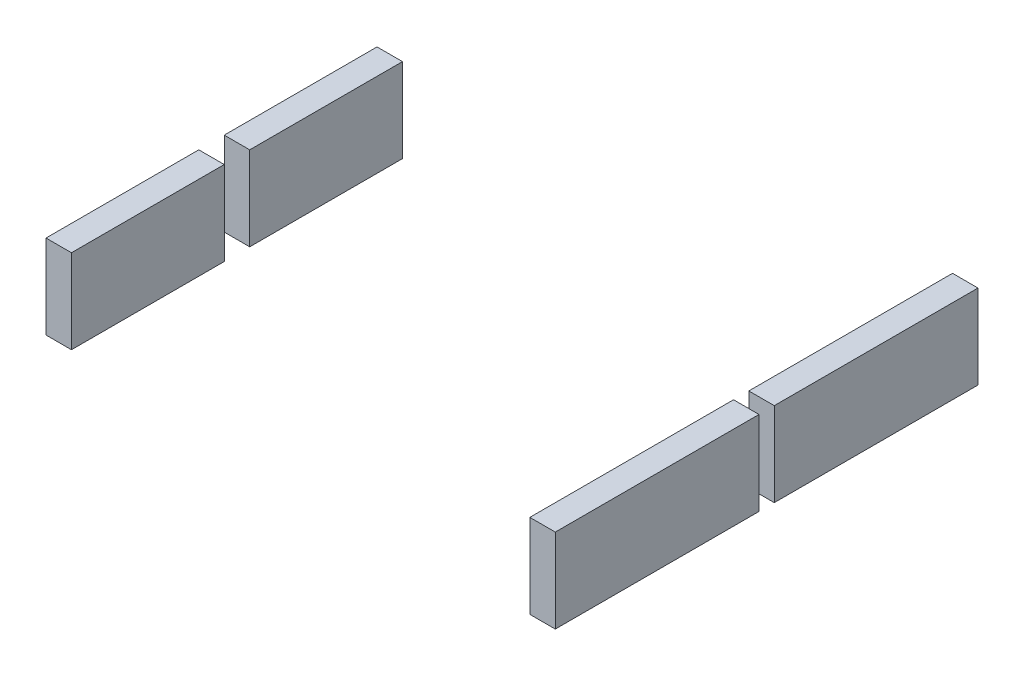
ISO-10303-21;
HEADER;
FILE_DESCRIPTION(('STEP AP214'),'2;1');
FILE_NAME('part.step','',(''),(''),'','','');
FILE_SCHEMA(('AUTOMOTIVE_DESIGN { 1 0 10303 214 1 1 1 1 }'));
ENDSEC;
DATA;
#1=APPLICATION_CONTEXT('core data for automotive mechanical design processes');
#2=APPLICATION_PROTOCOL_DEFINITION('international standard','automotive_design',2000,#1);
#3=PRODUCT_CONTEXT('',#1,'mechanical');
#4=PRODUCT('Part','Part','',(#3));
#5=PRODUCT_RELATED_PRODUCT_CATEGORY('part','',(#4));
#6=PRODUCT_DEFINITION_FORMATION('','',#4);
#7=PRODUCT_DEFINITION_CONTEXT('part definition',#1,'design');
#8=PRODUCT_DEFINITION('design','',#6,#7);
#9=PRODUCT_DEFINITION_SHAPE('','',#8);
#10=(LENGTH_UNIT() NAMED_UNIT(*) SI_UNIT(.MILLI.,.METRE.));
#11=(NAMED_UNIT(*) PLANE_ANGLE_UNIT() SI_UNIT($,.RADIAN.));
#12=(NAMED_UNIT(*) SI_UNIT($,.STERADIAN.) SOLID_ANGLE_UNIT());
#13=UNCERTAINTY_MEASURE_WITH_UNIT(LENGTH_MEASURE(1.E-05),#10,'distance_accuracy_value','');
#14=(GEOMETRIC_REPRESENTATION_CONTEXT(3) GLOBAL_UNCERTAINTY_ASSIGNED_CONTEXT((#13)) GLOBAL_UNIT_ASSIGNED_CONTEXT((#10,
#11,#12)) REPRESENTATION_CONTEXT('',''));
#15=CARTESIAN_POINT('',(0.,0.,0.));
#16=DIRECTION('',(0.,0.,1.));
#17=DIRECTION('',(1.,0.,0.));
#18=AXIS2_PLACEMENT_3D('',#15,#16,#17);
#19=CARTESIAN_POINT('',(-48.26,8.382,-17.78));
#20=DIRECTION('',(-1.,0.,0.));
#21=DIRECTION('',(0.,0.,1.));
#22=AXIS2_PLACEMENT_3D('',#19,#20,#21);
#23=PLANE('',#22);
#24=DIRECTION('',(0.,0.,-1.));
#25=VECTOR('',#24,1.);
#26=CARTESIAN_POINT('',(-48.26,0.,-17.78));
#27=LINE('',#26,#25);
#28=CARTESIAN_POINT('',(-48.26,0.,-17.78));
#29=VERTEX_POINT('',#28);
#30=CARTESIAN_POINT('',(-48.26,0.,-33.02));
#31=VERTEX_POINT('',#30);
#32=EDGE_CURVE('E104',#29,#31,#27,.T.);
#33=ORIENTED_EDGE('',*,*,#32,.T.);
#34=DIRECTION('',(0.,-1.,0.));
#35=VECTOR('',#34,1.);
#36=CARTESIAN_POINT('',(-48.26,8.382,-33.02));
#37=LINE('',#36,#35);
#38=CARTESIAN_POINT('',(-48.26,8.382,-33.02));
#39=VERTEX_POINT('',#38);
#40=EDGE_CURVE('E12',#39,#31,#37,.T.);
#41=ORIENTED_EDGE('',*,*,#40,.F.);
#42=DIRECTION('',(0.,0.,-1.));
#43=VECTOR('',#42,1.);
#44=CARTESIAN_POINT('',(-48.26,8.382,-17.78));
#45=LINE('',#44,#43);
#46=CARTESIAN_POINT('',(-48.26,8.382,-17.78));
#47=VERTEX_POINT('',#46);
#48=EDGE_CURVE('E92',#47,#39,#45,.T.);
#49=ORIENTED_EDGE('',*,*,#48,.F.);
#50=DIRECTION('',(0.,-1.,0.));
#51=VECTOR('',#50,1.);
#52=CARTESIAN_POINT('',(-48.26,8.382,-17.78));
#53=LINE('',#52,#51);
#54=EDGE_CURVE('E100',#47,#29,#53,.T.);
#55=ORIENTED_EDGE('',*,*,#54,.T.);
#56=EDGE_LOOP('',(#33,#41,#49,#55));
#57=FACE_BOUND('',#56,.T.);
#58=ADVANCED_FACE('F41',(#57),#23,.F.);
#59=CARTESIAN_POINT('',(-48.26,8.382,-33.02));
#60=DIRECTION('',(0.,0.,1.));
#61=DIRECTION('',(1.,0.,0.));
#62=AXIS2_PLACEMENT_3D('',#59,#60,#61);
#63=PLANE('',#62);
#64=DIRECTION('',(-1.,0.,0.));
#65=VECTOR('',#64,1.);
#66=CARTESIAN_POINT('',(-48.26,0.,-33.02));
#67=LINE('',#66,#65);
#68=CARTESIAN_POINT('',(-50.8,0.,-33.02));
#69=VERTEX_POINT('',#68);
#70=EDGE_CURVE('E96',#31,#69,#67,.T.);
#71=ORIENTED_EDGE('',*,*,#70,.T.);
#72=DIRECTION('',(0.,-1.,0.));
#73=VECTOR('',#72,1.);
#74=CARTESIAN_POINT('',(-50.8,8.382,-33.02));
#75=LINE('',#74,#73);
#76=CARTESIAN_POINT('',(-50.8,8.382,-33.02));
#77=VERTEX_POINT('',#76);
#78=EDGE_CURVE('E49',#77,#69,#75,.T.);
#79=ORIENTED_EDGE('',*,*,#78,.F.);
#80=DIRECTION('',(-1.,0.,0.));
#81=VECTOR('',#80,1.);
#82=CARTESIAN_POINT('',(-48.26,8.382,-33.02));
#83=LINE('',#82,#81);
#84=EDGE_CURVE('E87',#39,#77,#83,.T.);
#85=ORIENTED_EDGE('',*,*,#84,.F.);
#86=ORIENTED_EDGE('',*,*,#40,.T.);
#87=EDGE_LOOP('',(#71,#79,#85,#86));
#88=FACE_BOUND('',#87,.T.);
#89=ADVANCED_FACE('F95',(#88),#63,.F.);
#90=CARTESIAN_POINT('',(-50.8,8.382,-17.78));
#91=DIRECTION('',(1.,0.,0.));
#92=DIRECTION('',(0.,0.,-1.));
#93=AXIS2_PLACEMENT_3D('',#90,#91,#92);
#94=PLANE('',#93);
#95=DIRECTION('',(0.,0.,1.));
#96=VECTOR('',#95,1.);
#97=CARTESIAN_POINT('',(-50.8,0.,-17.78));
#98=LINE('',#97,#96);
#99=CARTESIAN_POINT('',(-50.8,0.,-17.78));
#100=VERTEX_POINT('',#99);
#101=EDGE_CURVE('E74',#69,#100,#98,.T.);
#102=ORIENTED_EDGE('',*,*,#101,.T.);
#103=DIRECTION('',(0.,-1.,0.));
#104=VECTOR('',#103,1.);
#105=CARTESIAN_POINT('',(-50.8,8.382,-17.78));
#106=LINE('',#105,#104);
#107=CARTESIAN_POINT('',(-50.8,8.382,-17.78));
#108=VERTEX_POINT('',#107);
#109=EDGE_CURVE('E97',#108,#100,#106,.T.);
#110=ORIENTED_EDGE('',*,*,#109,.F.);
#111=DIRECTION('',(0.,0.,1.));
#112=VECTOR('',#111,1.);
#113=CARTESIAN_POINT('',(-50.8,8.382,-17.78));
#114=LINE('',#113,#112);
#115=EDGE_CURVE('E90',#77,#108,#114,.T.);
#116=ORIENTED_EDGE('',*,*,#115,.F.);
#117=ORIENTED_EDGE('',*,*,#78,.T.);
#118=EDGE_LOOP('',(#102,#110,#116,#117));
#119=FACE_BOUND('',#118,.T.);
#120=ADVANCED_FACE('F98',(#119),#94,.F.);
#121=CARTESIAN_POINT('',(-48.26,8.382,-17.78));
#122=DIRECTION('',(0.,0.,-1.));
#123=DIRECTION('',(-1.,0.,0.));
#124=AXIS2_PLACEMENT_3D('',#121,#122,#123);
#125=PLANE('',#124);
#126=DIRECTION('',(1.,0.,0.));
#127=VECTOR('',#126,1.);
#128=CARTESIAN_POINT('',(-48.26,0.,-17.78));
#129=LINE('',#128,#127);
#130=EDGE_CURVE('E80',#100,#29,#129,.T.);
#131=ORIENTED_EDGE('',*,*,#130,.T.);
#132=ORIENTED_EDGE('',*,*,#54,.F.);
#133=DIRECTION('',(1.,0.,0.));
#134=VECTOR('',#133,1.);
#135=CARTESIAN_POINT('',(-48.26,8.382,-17.78));
#136=LINE('',#135,#134);
#137=EDGE_CURVE('E57',#108,#47,#136,.T.);
#138=ORIENTED_EDGE('',*,*,#137,.F.);
#139=ORIENTED_EDGE('',*,*,#109,.T.);
#140=EDGE_LOOP('',(#131,#132,#138,#139));
#141=FACE_BOUND('',#140,.T.);
#142=ADVANCED_FACE('F111',(#141),#125,.F.);
#143=CARTESIAN_POINT('',(-48.26,8.382,-33.02));
#144=DIRECTION('',(0.,1.,0.));
#145=DIRECTION('',(0.,0.,1.));
#146=AXIS2_PLACEMENT_3D('',#143,#144,#145);
#147=PLANE('',#146);
#148=ORIENTED_EDGE('',*,*,#48,.T.);
#149=ORIENTED_EDGE('',*,*,#84,.T.);
#150=ORIENTED_EDGE('',*,*,#115,.T.);
#151=ORIENTED_EDGE('',*,*,#137,.T.);
#152=EDGE_LOOP('',(#148,#149,#150,#151));
#153=FACE_BOUND('',#152,.T.);
#154=ADVANCED_FACE('F88',(#153),#147,.T.);
#155=CARTESIAN_POINT('',(-48.26,0.,-33.02));
#156=DIRECTION('',(0.,1.,0.));
#157=DIRECTION('',(0.,0.,1.));
#158=AXIS2_PLACEMENT_3D('',#155,#156,#157);
#159=PLANE('',#158);
#160=ORIENTED_EDGE('',*,*,#32,.F.);
#161=ORIENTED_EDGE('',*,*,#130,.F.);
#162=ORIENTED_EDGE('',*,*,#101,.F.);
#163=ORIENTED_EDGE('',*,*,#70,.F.);
#164=EDGE_LOOP('',(#160,#161,#162,#163));
#165=FACE_BOUND('',#164,.T.);
#166=ADVANCED_FACE('F114',(#165),#159,.F.);
#167=CLOSED_SHELL('',(#58,#89,#120,#142,#154,#166));
#168=MANIFOLD_SOLID_BREP('B2',#167);
#169=CARTESIAN_POINT('',(-48.26,8.382,0.));
#170=DIRECTION('',(-1.,0.,0.));
#171=DIRECTION('',(0.,0.,1.));
#172=AXIS2_PLACEMENT_3D('',#169,#170,#171);
#173=PLANE('',#172);
#174=DIRECTION('',(0.,0.,-1.));
#175=VECTOR('',#174,1.);
#176=CARTESIAN_POINT('',(-48.26,0.,0.));
#177=LINE('',#176,#175);
#178=CARTESIAN_POINT('',(-48.26,0.,0.));
#179=VERTEX_POINT('',#178);
#180=CARTESIAN_POINT('',(-48.26,0.,-15.24));
#181=VERTEX_POINT('',#180);
#182=EDGE_CURVE('E237',#179,#181,#177,.T.);
#183=ORIENTED_EDGE('',*,*,#182,.T.);
#184=DIRECTION('',(0.,-1.,0.));
#185=VECTOR('',#184,1.);
#186=CARTESIAN_POINT('',(-48.26,8.382,-15.24));
#187=LINE('',#186,#185);
#188=CARTESIAN_POINT('',(-48.26,8.382,-15.24));
#189=VERTEX_POINT('',#188);
#190=EDGE_CURVE('E39',#189,#181,#187,.T.);
#191=ORIENTED_EDGE('',*,*,#190,.F.);
#192=DIRECTION('',(0.,0.,-1.));
#193=VECTOR('',#192,1.);
#194=CARTESIAN_POINT('',(-48.26,8.382,0.));
#195=LINE('',#194,#193);
#196=CARTESIAN_POINT('',(-48.26,8.382,0.));
#197=VERTEX_POINT('',#196);
#198=EDGE_CURVE('E225',#197,#189,#195,.T.);
#199=ORIENTED_EDGE('',*,*,#198,.F.);
#200=DIRECTION('',(0.,-1.,0.));
#201=VECTOR('',#200,1.);
#202=CARTESIAN_POINT('',(-48.26,8.382,0.));
#203=LINE('',#202,#201);
#204=EDGE_CURVE('E233',#197,#179,#203,.T.);
#205=ORIENTED_EDGE('',*,*,#204,.T.);
#206=EDGE_LOOP('',(#183,#191,#199,#205));
#207=FACE_BOUND('',#206,.T.);
#208=ADVANCED_FACE('F174',(#207),#173,.F.);
#209=CARTESIAN_POINT('',(-48.26,8.382,-15.24));
#210=DIRECTION('',(0.,0.,1.));
#211=DIRECTION('',(1.,0.,0.));
#212=AXIS2_PLACEMENT_3D('',#209,#210,#211);
#213=PLANE('',#212);
#214=DIRECTION('',(-1.,0.,0.));
#215=VECTOR('',#214,1.);
#216=CARTESIAN_POINT('',(-48.26,0.,-15.24));
#217=LINE('',#216,#215);
#218=CARTESIAN_POINT('',(-50.8,0.,-15.24));
#219=VERTEX_POINT('',#218);
#220=EDGE_CURVE('E229',#181,#219,#217,.T.);
#221=ORIENTED_EDGE('',*,*,#220,.T.);
#222=DIRECTION('',(0.,-1.,0.));
#223=VECTOR('',#222,1.);
#224=CARTESIAN_POINT('',(-50.8,8.382,-15.24));
#225=LINE('',#224,#223);
#226=CARTESIAN_POINT('',(-50.8,8.382,-15.24));
#227=VERTEX_POINT('',#226);
#228=EDGE_CURVE('E182',#227,#219,#225,.T.);
#229=ORIENTED_EDGE('',*,*,#228,.F.);
#230=DIRECTION('',(-1.,0.,0.));
#231=VECTOR('',#230,1.);
#232=CARTESIAN_POINT('',(-48.26,8.382,-15.24));
#233=LINE('',#232,#231);
#234=EDGE_CURVE('E220',#189,#227,#233,.T.);
#235=ORIENTED_EDGE('',*,*,#234,.F.);
#236=ORIENTED_EDGE('',*,*,#190,.T.);
#237=EDGE_LOOP('',(#221,#229,#235,#236));
#238=FACE_BOUND('',#237,.T.);
#239=ADVANCED_FACE('F228',(#238),#213,.F.);
#240=CARTESIAN_POINT('',(-50.8,8.382,0.));
#241=DIRECTION('',(1.,0.,0.));
#242=DIRECTION('',(0.,0.,-1.));
#243=AXIS2_PLACEMENT_3D('',#240,#241,#242);
#244=PLANE('',#243);
#245=DIRECTION('',(0.,0.,1.));
#246=VECTOR('',#245,1.);
#247=CARTESIAN_POINT('',(-50.8,0.,0.));
#248=LINE('',#247,#246);
#249=CARTESIAN_POINT('',(-50.8,0.,0.));
#250=VERTEX_POINT('',#249);
#251=EDGE_CURVE('E207',#219,#250,#248,.T.);
#252=ORIENTED_EDGE('',*,*,#251,.T.);
#253=DIRECTION('',(0.,-1.,0.));
#254=VECTOR('',#253,1.);
#255=CARTESIAN_POINT('',(-50.8,8.382,0.));
#256=LINE('',#255,#254);
#257=CARTESIAN_POINT('',(-50.8,8.382,0.));
#258=VERTEX_POINT('',#257);
#259=EDGE_CURVE('E230',#258,#250,#256,.T.);
#260=ORIENTED_EDGE('',*,*,#259,.F.);
#261=DIRECTION('',(0.,0.,1.));
#262=VECTOR('',#261,1.);
#263=CARTESIAN_POINT('',(-50.8,8.382,0.));
#264=LINE('',#263,#262);
#265=EDGE_CURVE('E223',#227,#258,#264,.T.);
#266=ORIENTED_EDGE('',*,*,#265,.F.);
#267=ORIENTED_EDGE('',*,*,#228,.T.);
#268=EDGE_LOOP('',(#252,#260,#266,#267));
#269=FACE_BOUND('',#268,.T.);
#270=ADVANCED_FACE('F231',(#269),#244,.F.);
#271=CARTESIAN_POINT('',(-48.26,8.382,0.));
#272=DIRECTION('',(0.,0.,-1.));
#273=DIRECTION('',(-1.,0.,0.));
#274=AXIS2_PLACEMENT_3D('',#271,#272,#273);
#275=PLANE('',#274);
#276=DIRECTION('',(1.,0.,0.));
#277=VECTOR('',#276,1.);
#278=CARTESIAN_POINT('',(-48.26,0.,0.));
#279=LINE('',#278,#277);
#280=EDGE_CURVE('E213',#250,#179,#279,.T.);
#281=ORIENTED_EDGE('',*,*,#280,.T.);
#282=ORIENTED_EDGE('',*,*,#204,.F.);
#283=DIRECTION('',(1.,0.,0.));
#284=VECTOR('',#283,1.);
#285=CARTESIAN_POINT('',(-48.26,8.382,0.));
#286=LINE('',#285,#284);
#287=EDGE_CURVE('E190',#258,#197,#286,.T.);
#288=ORIENTED_EDGE('',*,*,#287,.F.);
#289=ORIENTED_EDGE('',*,*,#259,.T.);
#290=EDGE_LOOP('',(#281,#282,#288,#289));
#291=FACE_BOUND('',#290,.T.);
#292=ADVANCED_FACE('F244',(#291),#275,.F.);
#293=CARTESIAN_POINT('',(-48.26,8.382,-15.24));
#294=DIRECTION('',(0.,1.,0.));
#295=DIRECTION('',(0.,0.,1.));
#296=AXIS2_PLACEMENT_3D('',#293,#294,#295);
#297=PLANE('',#296);
#298=ORIENTED_EDGE('',*,*,#198,.T.);
#299=ORIENTED_EDGE('',*,*,#234,.T.);
#300=ORIENTED_EDGE('',*,*,#265,.T.);
#301=ORIENTED_EDGE('',*,*,#287,.T.);
#302=EDGE_LOOP('',(#298,#299,#300,#301));
#303=FACE_BOUND('',#302,.T.);
#304=ADVANCED_FACE('F221',(#303),#297,.T.);
#305=CARTESIAN_POINT('',(-48.26,0.,-15.24));
#306=DIRECTION('',(0.,1.,0.));
#307=DIRECTION('',(0.,0.,1.));
#308=AXIS2_PLACEMENT_3D('',#305,#306,#307);
#309=PLANE('',#308);
#310=ORIENTED_EDGE('',*,*,#182,.F.);
#311=ORIENTED_EDGE('',*,*,#280,.F.);
#312=ORIENTED_EDGE('',*,*,#251,.F.);
#313=ORIENTED_EDGE('',*,*,#220,.F.);
#314=EDGE_LOOP('',(#310,#311,#312,#313));
#315=FACE_BOUND('',#314,.T.);
#316=ADVANCED_FACE('F247',(#315),#309,.F.);
#317=CLOSED_SHELL('',(#208,#239,#270,#292,#304,#316));
#318=MANIFOLD_SOLID_BREP('B6',#317);
#319=CARTESIAN_POINT('',(0.,8.382,-21.844));
#320=DIRECTION('',(-1.,0.,0.));
#321=DIRECTION('',(0.,0.,1.));
#322=AXIS2_PLACEMENT_3D('',#319,#320,#321);
#323=PLANE('',#322);
#324=DIRECTION('',(0.,0.,-1.));
#325=VECTOR('',#324,1.);
#326=CARTESIAN_POINT('',(0.,0.,-21.844));
#327=LINE('',#326,#325);
#328=CARTESIAN_POINT('',(0.,0.,-21.844));
#329=VERTEX_POINT('',#328);
#330=CARTESIAN_POINT('',(0.,0.,-42.164));
#331=VERTEX_POINT('',#330);
#332=EDGE_CURVE('E369',#329,#331,#327,.T.);
#333=ORIENTED_EDGE('',*,*,#332,.T.);
#334=DIRECTION('',(0.,-1.,0.));
#335=VECTOR('',#334,1.);
#336=CARTESIAN_POINT('',(0.,8.382,-42.164));
#337=LINE('',#336,#335);
#338=CARTESIAN_POINT('',(0.,8.382,-42.164));
#339=VERTEX_POINT('',#338);
#340=EDGE_CURVE('E172',#339,#331,#337,.T.);
#341=ORIENTED_EDGE('',*,*,#340,.F.);
#342=DIRECTION('',(0.,0.,-1.));
#343=VECTOR('',#342,1.);
#344=CARTESIAN_POINT('',(0.,8.382,-21.844));
#345=LINE('',#344,#343);
#346=CARTESIAN_POINT('',(0.,8.382,-21.844));
#347=VERTEX_POINT('',#346);
#348=EDGE_CURVE('E357',#347,#339,#345,.T.);
#349=ORIENTED_EDGE('',*,*,#348,.F.);
#350=DIRECTION('',(0.,-1.,0.));
#351=VECTOR('',#350,1.);
#352=CARTESIAN_POINT('',(0.,8.382,-21.844));
#353=LINE('',#352,#351);
#354=EDGE_CURVE('E365',#347,#329,#353,.T.);
#355=ORIENTED_EDGE('',*,*,#354,.T.);
#356=EDGE_LOOP('',(#333,#341,#349,#355));
#357=FACE_BOUND('',#356,.T.);
#358=ADVANCED_FACE('F306',(#357),#323,.F.);
#359=CARTESIAN_POINT('',(0.,8.382,-42.164));
#360=DIRECTION('',(0.,0.,1.));
#361=DIRECTION('',(1.,0.,0.));
#362=AXIS2_PLACEMENT_3D('',#359,#360,#361);
#363=PLANE('',#362);
#364=DIRECTION('',(-1.,0.,0.));
#365=VECTOR('',#364,1.);
#366=CARTESIAN_POINT('',(0.,0.,-42.164));
#367=LINE('',#366,#365);
#368=CARTESIAN_POINT('',(-2.54,0.,-42.164));
#369=VERTEX_POINT('',#368);
#370=EDGE_CURVE('E361',#331,#369,#367,.T.);
#371=ORIENTED_EDGE('',*,*,#370,.T.);
#372=DIRECTION('',(0.,-1.,0.));
#373=VECTOR('',#372,1.);
#374=CARTESIAN_POINT('',(-2.54,8.382,-42.164));
#375=LINE('',#374,#373);
#376=CARTESIAN_POINT('',(-2.54,8.382,-42.164));
#377=VERTEX_POINT('',#376);
#378=EDGE_CURVE('E314',#377,#369,#375,.T.);
#379=ORIENTED_EDGE('',*,*,#378,.F.);
#380=DIRECTION('',(-1.,0.,0.));
#381=VECTOR('',#380,1.);
#382=CARTESIAN_POINT('',(0.,8.382,-42.164));
#383=LINE('',#382,#381);
#384=EDGE_CURVE('E352',#339,#377,#383,.T.);
#385=ORIENTED_EDGE('',*,*,#384,.F.);
#386=ORIENTED_EDGE('',*,*,#340,.T.);
#387=EDGE_LOOP('',(#371,#379,#385,#386));
#388=FACE_BOUND('',#387,.T.);
#389=ADVANCED_FACE('F360',(#388),#363,.F.);
#390=CARTESIAN_POINT('',(-2.54,8.382,-21.844));
#391=DIRECTION('',(1.,0.,0.));
#392=DIRECTION('',(0.,0.,-1.));
#393=AXIS2_PLACEMENT_3D('',#390,#391,#392);
#394=PLANE('',#393);
#395=DIRECTION('',(0.,0.,1.));
#396=VECTOR('',#395,1.);
#397=CARTESIAN_POINT('',(-2.54,0.,-21.844));
#398=LINE('',#397,#396);
#399=CARTESIAN_POINT('',(-2.54,0.,-21.844));
#400=VERTEX_POINT('',#399);
#401=EDGE_CURVE('E339',#369,#400,#398,.T.);
#402=ORIENTED_EDGE('',*,*,#401,.T.);
#403=DIRECTION('',(0.,-1.,0.));
#404=VECTOR('',#403,1.);
#405=CARTESIAN_POINT('',(-2.54,8.382,-21.844));
#406=LINE('',#405,#404);
#407=CARTESIAN_POINT('',(-2.54,8.382,-21.844));
#408=VERTEX_POINT('',#407);
#409=EDGE_CURVE('E362',#408,#400,#406,.T.);
#410=ORIENTED_EDGE('',*,*,#409,.F.);
#411=DIRECTION('',(0.,0.,1.));
#412=VECTOR('',#411,1.);
#413=CARTESIAN_POINT('',(-2.54,8.382,-21.844));
#414=LINE('',#413,#412);
#415=EDGE_CURVE('E355',#377,#408,#414,.T.);
#416=ORIENTED_EDGE('',*,*,#415,.F.);
#417=ORIENTED_EDGE('',*,*,#378,.T.);
#418=EDGE_LOOP('',(#402,#410,#416,#417));
#419=FACE_BOUND('',#418,.T.);
#420=ADVANCED_FACE('F363',(#419),#394,.F.);
#421=CARTESIAN_POINT('',(0.,8.382,-21.844));
#422=DIRECTION('',(0.,0.,-1.));
#423=DIRECTION('',(-1.,0.,0.));
#424=AXIS2_PLACEMENT_3D('',#421,#422,#423);
#425=PLANE('',#424);
#426=DIRECTION('',(1.,0.,0.));
#427=VECTOR('',#426,1.);
#428=CARTESIAN_POINT('',(0.,0.,-21.844));
#429=LINE('',#428,#427);
#430=EDGE_CURVE('E345',#400,#329,#429,.T.);
#431=ORIENTED_EDGE('',*,*,#430,.T.);
#432=ORIENTED_EDGE('',*,*,#354,.F.);
#433=DIRECTION('',(1.,0.,0.));
#434=VECTOR('',#433,1.);
#435=CARTESIAN_POINT('',(0.,8.382,-21.844));
#436=LINE('',#435,#434);
#437=EDGE_CURVE('E322',#408,#347,#436,.T.);
#438=ORIENTED_EDGE('',*,*,#437,.F.);
#439=ORIENTED_EDGE('',*,*,#409,.T.);
#440=EDGE_LOOP('',(#431,#432,#438,#439));
#441=FACE_BOUND('',#440,.T.);
#442=ADVANCED_FACE('F376',(#441),#425,.F.);
#443=CARTESIAN_POINT('',(0.,8.382,-42.164));
#444=DIRECTION('',(0.,1.,0.));
#445=DIRECTION('',(0.,0.,1.));
#446=AXIS2_PLACEMENT_3D('',#443,#444,#445);
#447=PLANE('',#446);
#448=ORIENTED_EDGE('',*,*,#348,.T.);
#449=ORIENTED_EDGE('',*,*,#384,.T.);
#450=ORIENTED_EDGE('',*,*,#415,.T.);
#451=ORIENTED_EDGE('',*,*,#437,.T.);
#452=EDGE_LOOP('',(#448,#449,#450,#451));
#453=FACE_BOUND('',#452,.T.);
#454=ADVANCED_FACE('F353',(#453),#447,.T.);
#455=CARTESIAN_POINT('',(0.,0.,-42.164));
#456=DIRECTION('',(0.,1.,0.));
#457=DIRECTION('',(0.,0.,1.));
#458=AXIS2_PLACEMENT_3D('',#455,#456,#457);
#459=PLANE('',#458);
#460=ORIENTED_EDGE('',*,*,#332,.F.);
#461=ORIENTED_EDGE('',*,*,#430,.F.);
#462=ORIENTED_EDGE('',*,*,#401,.F.);
#463=ORIENTED_EDGE('',*,*,#370,.F.);
#464=EDGE_LOOP('',(#460,#461,#462,#463));
#465=FACE_BOUND('',#464,.T.);
#466=ADVANCED_FACE('F379',(#465),#459,.F.);
#467=CLOSED_SHELL('',(#358,#389,#420,#442,#454,#466));
#468=MANIFOLD_SOLID_BREP('B33',#467);
#469=CARTESIAN_POINT('',(0.,8.382,0.));
#470=DIRECTION('',(-1.,0.,0.));
#471=DIRECTION('',(0.,0.,1.));
#472=AXIS2_PLACEMENT_3D('',#469,#470,#471);
#473=PLANE('',#472);
#474=DIRECTION('',(0.,0.,-1.));
#475=VECTOR('',#474,1.);
#476=CARTESIAN_POINT('',(0.,0.,0.));
#477=LINE('',#476,#475);
#478=CARTESIAN_POINT('',(0.,0.,0.));
#479=VERTEX_POINT('',#478);
#480=CARTESIAN_POINT('',(0.,0.,-20.32));
#481=VERTEX_POINT('',#480);
#482=EDGE_CURVE('E492',#479,#481,#477,.T.);
#483=ORIENTED_EDGE('',*,*,#482,.T.);
#484=DIRECTION('',(0.,-1.,0.));
#485=VECTOR('',#484,1.);
#486=CARTESIAN_POINT('',(0.,8.382,-20.32));
#487=LINE('',#486,#485);
#488=CARTESIAN_POINT('',(0.,8.382,-20.32));
#489=VERTEX_POINT('',#488);
#490=EDGE_CURVE('E304',#489,#481,#487,.T.);
#491=ORIENTED_EDGE('',*,*,#490,.F.);
#492=DIRECTION('',(0.,0.,-1.));
#493=VECTOR('',#492,1.);
#494=CARTESIAN_POINT('',(0.,8.382,0.));
#495=LINE('',#494,#493);
#496=CARTESIAN_POINT('',(0.,8.382,0.));
#497=VERTEX_POINT('',#496);
#498=EDGE_CURVE('E480',#497,#489,#495,.T.);
#499=ORIENTED_EDGE('',*,*,#498,.F.);
#500=DIRECTION('',(0.,-1.,0.));
#501=VECTOR('',#500,1.);
#502=CARTESIAN_POINT('',(0.,8.382,0.));
#503=LINE('',#502,#501);
#504=EDGE_CURVE('E488',#497,#479,#503,.T.);
#505=ORIENTED_EDGE('',*,*,#504,.T.);
#506=EDGE_LOOP('',(#483,#491,#499,#505));
#507=FACE_BOUND('',#506,.T.);
#508=ADVANCED_FACE('F429',(#507),#473,.F.);
#509=CARTESIAN_POINT('',(0.,8.382,-20.32));
#510=DIRECTION('',(0.,0.,1.));
#511=DIRECTION('',(1.,0.,0.));
#512=AXIS2_PLACEMENT_3D('',#509,#510,#511);
#513=PLANE('',#512);
#514=DIRECTION('',(-1.,0.,0.));
#515=VECTOR('',#514,1.);
#516=CARTESIAN_POINT('',(0.,0.,-20.32));
#517=LINE('',#516,#515);
#518=CARTESIAN_POINT('',(-2.54,0.,-20.32));
#519=VERTEX_POINT('',#518);
#520=EDGE_CURVE('E484',#481,#519,#517,.T.);
#521=ORIENTED_EDGE('',*,*,#520,.T.);
#522=DIRECTION('',(0.,-1.,0.));
#523=VECTOR('',#522,1.);
#524=CARTESIAN_POINT('',(-2.54,8.382,-20.32));
#525=LINE('',#524,#523);
#526=CARTESIAN_POINT('',(-2.54,8.382,-20.32));
#527=VERTEX_POINT('',#526);
#528=EDGE_CURVE('E437',#527,#519,#525,.T.);
#529=ORIENTED_EDGE('',*,*,#528,.F.);
#530=DIRECTION('',(-1.,0.,0.));
#531=VECTOR('',#530,1.);
#532=CARTESIAN_POINT('',(0.,8.382,-20.32));
#533=LINE('',#532,#531);
#534=EDGE_CURVE('E475',#489,#527,#533,.T.);
#535=ORIENTED_EDGE('',*,*,#534,.F.);
#536=ORIENTED_EDGE('',*,*,#490,.T.);
#537=EDGE_LOOP('',(#521,#529,#535,#536));
#538=FACE_BOUND('',#537,.T.);
#539=ADVANCED_FACE('F483',(#538),#513,.F.);
#540=CARTESIAN_POINT('',(-2.54,8.382,0.));
#541=DIRECTION('',(1.,0.,0.));
#542=DIRECTION('',(0.,0.,-1.));
#543=AXIS2_PLACEMENT_3D('',#540,#541,#542);
#544=PLANE('',#543);
#545=DIRECTION('',(0.,0.,1.));
#546=VECTOR('',#545,1.);
#547=CARTESIAN_POINT('',(-2.54,0.,0.));
#548=LINE('',#547,#546);
#549=CARTESIAN_POINT('',(-2.54,0.,0.));
#550=VERTEX_POINT('',#549);
#551=EDGE_CURVE('E462',#519,#550,#548,.T.);
#552=ORIENTED_EDGE('',*,*,#551,.T.);
#553=DIRECTION('',(0.,-1.,0.));
#554=VECTOR('',#553,1.);
#555=CARTESIAN_POINT('',(-2.54,8.382,0.));
#556=LINE('',#555,#554);
#557=CARTESIAN_POINT('',(-2.54,8.382,0.));
#558=VERTEX_POINT('',#557);
#559=EDGE_CURVE('E485',#558,#550,#556,.T.);
#560=ORIENTED_EDGE('',*,*,#559,.F.);
#561=DIRECTION('',(0.,0.,1.));
#562=VECTOR('',#561,1.);
#563=CARTESIAN_POINT('',(-2.54,8.382,0.));
#564=LINE('',#563,#562);
#565=EDGE_CURVE('E478',#527,#558,#564,.T.);
#566=ORIENTED_EDGE('',*,*,#565,.F.);
#567=ORIENTED_EDGE('',*,*,#528,.T.);
#568=EDGE_LOOP('',(#552,#560,#566,#567));
#569=FACE_BOUND('',#568,.T.);
#570=ADVANCED_FACE('F486',(#569),#544,.F.);
#571=CARTESIAN_POINT('',(0.,8.382,0.));
#572=DIRECTION('',(0.,0.,-1.));
#573=DIRECTION('',(-1.,0.,0.));
#574=AXIS2_PLACEMENT_3D('',#571,#572,#573);
#575=PLANE('',#574);
#576=DIRECTION('',(1.,0.,0.));
#577=VECTOR('',#576,1.);
#578=CARTESIAN_POINT('',(0.,0.,0.));
#579=LINE('',#578,#577);
#580=EDGE_CURVE('E468',#550,#479,#579,.T.);
#581=ORIENTED_EDGE('',*,*,#580,.T.);
#582=ORIENTED_EDGE('',*,*,#504,.F.);
#583=DIRECTION('',(1.,0.,0.));
#584=VECTOR('',#583,1.);
#585=CARTESIAN_POINT('',(0.,8.382,0.));
#586=LINE('',#585,#584);
#587=EDGE_CURVE('E445',#558,#497,#586,.T.);
#588=ORIENTED_EDGE('',*,*,#587,.F.);
#589=ORIENTED_EDGE('',*,*,#559,.T.);
#590=EDGE_LOOP('',(#581,#582,#588,#589));
#591=FACE_BOUND('',#590,.T.);
#592=ADVANCED_FACE('F499',(#591),#575,.F.);
#593=CARTESIAN_POINT('',(0.,8.382,-20.32));
#594=DIRECTION('',(0.,1.,0.));
#595=DIRECTION('',(0.,0.,1.));
#596=AXIS2_PLACEMENT_3D('',#593,#594,#595);
#597=PLANE('',#596);
#598=ORIENTED_EDGE('',*,*,#498,.T.);
#599=ORIENTED_EDGE('',*,*,#534,.T.);
#600=ORIENTED_EDGE('',*,*,#565,.T.);
#601=ORIENTED_EDGE('',*,*,#587,.T.);
#602=EDGE_LOOP('',(#598,#599,#600,#601));
#603=FACE_BOUND('',#602,.T.);
#604=ADVANCED_FACE('F476',(#603),#597,.T.);
#605=CARTESIAN_POINT('',(0.,0.,-20.32));
#606=DIRECTION('',(0.,1.,0.));
#607=DIRECTION('',(0.,0.,1.));
#608=AXIS2_PLACEMENT_3D('',#605,#606,#607);
#609=PLANE('',#608);
#610=ORIENTED_EDGE('',*,*,#482,.F.);
#611=ORIENTED_EDGE('',*,*,#580,.F.);
#612=ORIENTED_EDGE('',*,*,#551,.F.);
#613=ORIENTED_EDGE('',*,*,#520,.F.);
#614=EDGE_LOOP('',(#610,#611,#612,#613));
#615=FACE_BOUND('',#614,.T.);
#616=ADVANCED_FACE('F502',(#615),#609,.F.);
#617=CLOSED_SHELL('',(#508,#539,#570,#592,#604,#616));
#618=MANIFOLD_SOLID_BREP('B166',#617);
#619=ADVANCED_BREP_SHAPE_REPRESENTATION('',(#18,#168,#318,#468,#618),#14);
#620=SHAPE_DEFINITION_REPRESENTATION(#9,#619);
ENDSEC;
END-ISO-10303-21;
